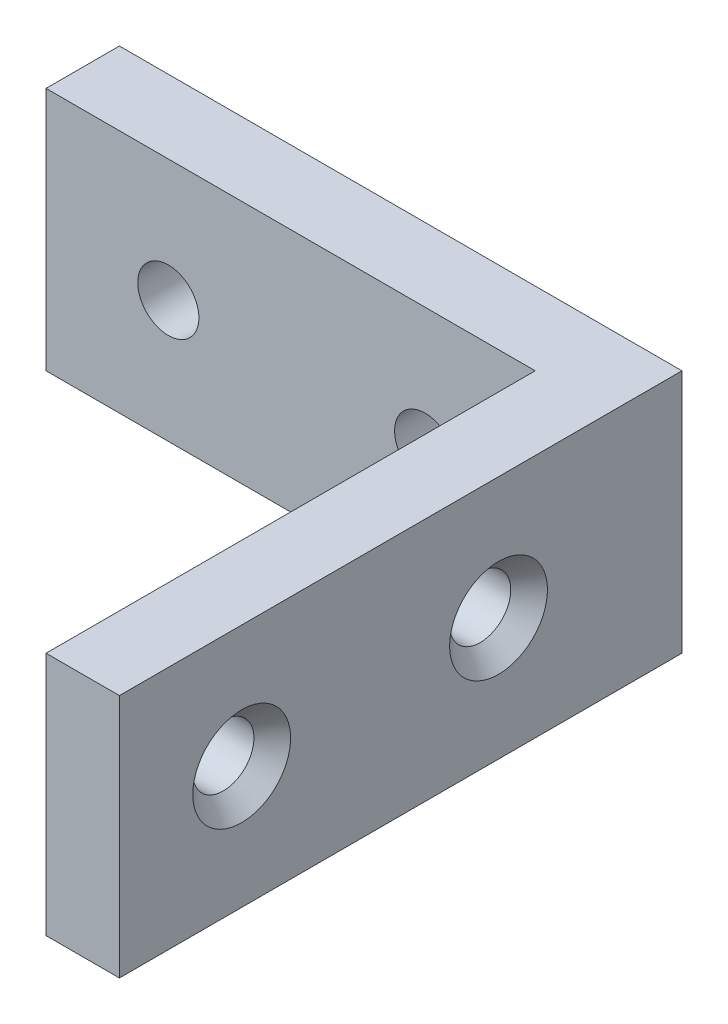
ISO-10303-21;
HEADER;
FILE_DESCRIPTION(('STEP AP214'),'2;1');
FILE_NAME('part.step','',(''),(''),'','','');
FILE_SCHEMA(('AUTOMOTIVE_DESIGN { 1 0 10303 214 1 1 1 1 }'));
ENDSEC;
DATA;
#1=APPLICATION_CONTEXT('core data for automotive mechanical design processes');
#2=APPLICATION_PROTOCOL_DEFINITION('international standard','automotive_design',2000,#1);
#3=PRODUCT_CONTEXT('',#1,'mechanical');
#4=PRODUCT('Part','Part','',(#3));
#5=PRODUCT_RELATED_PRODUCT_CATEGORY('part','',(#4));
#6=PRODUCT_DEFINITION_FORMATION('','',#4);
#7=PRODUCT_DEFINITION_CONTEXT('part definition',#1,'design');
#8=PRODUCT_DEFINITION('design','',#6,#7);
#9=PRODUCT_DEFINITION_SHAPE('','',#8);
#10=(LENGTH_UNIT() NAMED_UNIT(*) SI_UNIT(.MILLI.,.METRE.));
#11=(NAMED_UNIT(*) PLANE_ANGLE_UNIT() SI_UNIT($,.RADIAN.));
#12=(NAMED_UNIT(*) SI_UNIT($,.STERADIAN.) SOLID_ANGLE_UNIT());
#13=UNCERTAINTY_MEASURE_WITH_UNIT(LENGTH_MEASURE(1.E-05),#10,'distance_accuracy_value','');
#14=(GEOMETRIC_REPRESENTATION_CONTEXT(3) GLOBAL_UNCERTAINTY_ASSIGNED_CONTEXT((#13)) GLOBAL_UNIT_ASSIGNED_CONTEXT((#10,
#11,#12)) REPRESENTATION_CONTEXT('',''));
#15=CARTESIAN_POINT('',(0.,0.,0.));
#16=DIRECTION('',(0.,0.,1.));
#17=DIRECTION('',(1.,0.,0.));
#18=AXIS2_PLACEMENT_3D('',#15,#16,#17);
#19=CARTESIAN_POINT('',(0.,20.,-6.));
#20=DIRECTION('',(1.,0.,0.));
#21=DIRECTION('',(0.,0.,-1.));
#22=AXIS2_PLACEMENT_3D('',#19,#20,#21);
#23=PLANE('',#22);
#24=DIRECTION('',(0.,0.,1.));
#25=VECTOR('',#24,1.);
#26=CARTESIAN_POINT('',(0.,0.,-6.));
#27=LINE('',#26,#25);
#28=CARTESIAN_POINT('',(0.,0.,-6.));
#29=VERTEX_POINT('',#28);
#30=CARTESIAN_POINT('',(0.,0.,0.));
#31=VERTEX_POINT('',#30);
#32=EDGE_CURVE('E122',#29,#31,#27,.T.);
#33=ORIENTED_EDGE('',*,*,#32,.T.);
#34=DIRECTION('',(0.,-1.,0.));
#35=VECTOR('',#34,1.);
#36=CARTESIAN_POINT('',(0.,20.,0.));
#37=LINE('',#36,#35);
#38=CARTESIAN_POINT('',(0.,20.,0.));
#39=VERTEX_POINT('',#38);
#40=EDGE_CURVE('E140',#39,#31,#37,.T.);
#41=ORIENTED_EDGE('',*,*,#40,.F.);
#42=DIRECTION('',(0.,0.,1.));
#43=VECTOR('',#42,1.);
#44=CARTESIAN_POINT('',(0.,20.,-6.));
#45=LINE('',#44,#43);
#46=CARTESIAN_POINT('',(0.,20.,-6.));
#47=VERTEX_POINT('',#46);
#48=EDGE_CURVE('E133',#47,#39,#45,.T.);
#49=ORIENTED_EDGE('',*,*,#48,.F.);
#50=DIRECTION('',(0.,-1.,0.));
#51=VECTOR('',#50,1.);
#52=CARTESIAN_POINT('',(0.,20.,-6.));
#53=LINE('',#52,#51);
#54=EDGE_CURVE('E118',#47,#29,#53,.T.);
#55=ORIENTED_EDGE('',*,*,#54,.T.);
#56=EDGE_LOOP('',(#33,#41,#49,#55));
#57=FACE_BOUND('',#56,.T.);
#58=ADVANCED_FACE('F35',(#57),#23,.F.);
#59=CARTESIAN_POINT('',(0.,20.,0.));
#60=DIRECTION('',(0.,0.,-1.));
#61=DIRECTION('',(-1.,0.,0.));
#62=AXIS2_PLACEMENT_3D('',#59,#60,#61);
#63=PLANE('',#62);
#64=CARTESIAN_POINT('',(10.,10.,0.));
#65=DIRECTION('',(0.,0.,-1.));
#66=DIRECTION('',(-1.,0.,0.));
#67=AXIS2_PLACEMENT_3D('',#64,#65,#66);
#68=CIRCLE('',#67,2.5);
#69=CARTESIAN_POINT('',(7.5,10.,0.));
#70=VERTEX_POINT('',#69);
#71=EDGE_CURVE('E181',#70,#70,#68,.T.);
#72=ORIENTED_EDGE('',*,*,#71,.T.);
#73=EDGE_LOOP('',(#72));
#74=FACE_BOUND('',#73,.T.);
#75=CARTESIAN_POINT('',(31.,10.,0.));
#76=DIRECTION('',(0.,0.,-1.));
#77=DIRECTION('',(-1.,0.,0.));
#78=AXIS2_PLACEMENT_3D('',#75,#76,#77);
#79=CIRCLE('',#78,2.5);
#80=CARTESIAN_POINT('',(28.5,10.,0.));
#81=VERTEX_POINT('',#80);
#82=EDGE_CURVE('E179',#81,#81,#79,.T.);
#83=ORIENTED_EDGE('',*,*,#82,.T.);
#84=EDGE_LOOP('',(#83));
#85=FACE_BOUND('',#84,.T.);
#86=DIRECTION('',(1.,0.,0.));
#87=VECTOR('',#86,1.);
#88=CARTESIAN_POINT('',(0.,0.,0.));
#89=LINE('',#88,#87);
#90=CARTESIAN_POINT('',(40.,0.,0.));
#91=VERTEX_POINT('',#90);
#92=EDGE_CURVE('E125',#31,#91,#89,.T.);
#93=ORIENTED_EDGE('',*,*,#92,.T.);
#94=DIRECTION('',(0.,-1.,0.));
#95=VECTOR('',#94,1.);
#96=CARTESIAN_POINT('',(40.,20.,0.));
#97=LINE('',#96,#95);
#98=CARTESIAN_POINT('',(40.,20.,0.));
#99=VERTEX_POINT('',#98);
#100=EDGE_CURVE('E137',#99,#91,#97,.T.);
#101=ORIENTED_EDGE('',*,*,#100,.F.);
#102=DIRECTION('',(1.,0.,0.));
#103=VECTOR('',#102,1.);
#104=CARTESIAN_POINT('',(0.,20.,0.));
#105=LINE('',#104,#103);
#106=EDGE_CURVE('E91',#39,#99,#105,.T.);
#107=ORIENTED_EDGE('',*,*,#106,.F.);
#108=ORIENTED_EDGE('',*,*,#40,.T.);
#109=EDGE_LOOP('',(#93,#101,#107,#108));
#110=FACE_BOUND('',#109,.T.);
#111=ADVANCED_FACE('F194',(#74,#85,#110),#63,.F.);
#112=CARTESIAN_POINT('',(40.,20.,0.));
#113=DIRECTION('',(1.,0.,0.));
#114=DIRECTION('',(0.,0.,-1.));
#115=AXIS2_PLACEMENT_3D('',#112,#113,#114);
#116=PLANE('',#115);
#117=CARTESIAN_POINT('',(40.,10.,30.));
#118=DIRECTION('',(1.,0.,0.));
#119=DIRECTION('',(0.,0.,-1.));
#120=AXIS2_PLACEMENT_3D('',#117,#118,#119);
#121=CIRCLE('',#120,2.5);
#122=CARTESIAN_POINT('',(40.,10.,27.5));
#123=VERTEX_POINT('',#122);
#124=EDGE_CURVE('E126',#123,#123,#121,.F.);
#125=ORIENTED_EDGE('',*,*,#124,.F.);
#126=EDGE_LOOP('',(#125));
#127=FACE_BOUND('',#126,.T.);
#128=CARTESIAN_POINT('',(40.,10.,9.));
#129=DIRECTION('',(1.,0.,0.));
#130=DIRECTION('',(0.,0.,-1.));
#131=AXIS2_PLACEMENT_3D('',#128,#129,#130);
#132=CIRCLE('',#131,2.5);
#133=CARTESIAN_POINT('',(40.,10.,6.5));
#134=VERTEX_POINT('',#133);
#135=EDGE_CURVE('E184',#134,#134,#132,.F.);
#136=ORIENTED_EDGE('',*,*,#135,.F.);
#137=EDGE_LOOP('',(#136));
#138=FACE_BOUND('',#137,.T.);
#139=DIRECTION('',(0.,0.,1.));
#140=VECTOR('',#139,1.);
#141=CARTESIAN_POINT('',(40.,0.,0.));
#142=LINE('',#141,#140);
#143=CARTESIAN_POINT('',(40.,0.,40.));
#144=VERTEX_POINT('',#143);
#145=EDGE_CURVE('E128',#91,#144,#142,.T.);
#146=ORIENTED_EDGE('',*,*,#145,.T.);
#147=DIRECTION('',(0.,-1.,0.));
#148=VECTOR('',#147,1.);
#149=CARTESIAN_POINT('',(40.,20.,40.));
#150=LINE('',#149,#148);
#151=CARTESIAN_POINT('',(40.,20.,40.));
#152=VERTEX_POINT('',#151);
#153=EDGE_CURVE('E113',#152,#144,#150,.T.);
#154=ORIENTED_EDGE('',*,*,#153,.F.);
#155=DIRECTION('',(0.,0.,1.));
#156=VECTOR('',#155,1.);
#157=CARTESIAN_POINT('',(40.,20.,0.));
#158=LINE('',#157,#156);
#159=EDGE_CURVE('E104',#99,#152,#158,.T.);
#160=ORIENTED_EDGE('',*,*,#159,.F.);
#161=ORIENTED_EDGE('',*,*,#100,.T.);
#162=EDGE_LOOP('',(#146,#154,#160,#161));
#163=FACE_BOUND('',#162,.T.);
#164=ADVANCED_FACE('F197',(#127,#138,#163),#116,.F.);
#165=CARTESIAN_POINT('',(40.,20.,40.));
#166=DIRECTION('',(0.,0.,-1.));
#167=DIRECTION('',(-1.,0.,0.));
#168=AXIS2_PLACEMENT_3D('',#165,#166,#167);
#169=PLANE('',#168);
#170=DIRECTION('',(1.,0.,0.));
#171=VECTOR('',#170,1.);
#172=CARTESIAN_POINT('',(40.,0.,40.));
#173=LINE('',#172,#171);
#174=CARTESIAN_POINT('',(46.,0.,40.));
#175=VERTEX_POINT('',#174);
#176=EDGE_CURVE('E112',#144,#175,#173,.T.);
#177=ORIENTED_EDGE('',*,*,#176,.T.);
#178=DIRECTION('',(0.,-1.,0.));
#179=VECTOR('',#178,1.);
#180=CARTESIAN_POINT('',(46.,20.,40.));
#181=LINE('',#180,#179);
#182=CARTESIAN_POINT('',(46.,20.,40.));
#183=VERTEX_POINT('',#182);
#184=EDGE_CURVE('E109',#183,#175,#181,.T.);
#185=ORIENTED_EDGE('',*,*,#184,.F.);
#186=DIRECTION('',(1.,0.,0.));
#187=VECTOR('',#186,1.);
#188=CARTESIAN_POINT('',(40.,20.,40.));
#189=LINE('',#188,#187);
#190=EDGE_CURVE('E98',#152,#183,#189,.T.);
#191=ORIENTED_EDGE('',*,*,#190,.F.);
#192=ORIENTED_EDGE('',*,*,#153,.T.);
#193=EDGE_LOOP('',(#177,#185,#191,#192));
#194=FACE_BOUND('',#193,.T.);
#195=ADVANCED_FACE('F110',(#194),#169,.F.);
#196=CARTESIAN_POINT('',(46.,20.,-6.));
#197=DIRECTION('',(-1.,0.,0.));
#198=DIRECTION('',(0.,0.,1.));
#199=AXIS2_PLACEMENT_3D('',#196,#197,#198);
#200=PLANE('',#199);
#201=CARTESIAN_POINT('',(46.,10.,30.));
#202=DIRECTION('',(-1.,0.,0.));
#203=DIRECTION('',(0.,0.,1.));
#204=AXIS2_PLACEMENT_3D('',#201,#202,#203);
#205=CIRCLE('',#204,4.00000000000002);
#206=CARTESIAN_POINT('',(46.,10.,34.));
#207=VERTEX_POINT('',#206);
#208=EDGE_CURVE('E148',#207,#207,#205,.T.);
#209=ORIENTED_EDGE('',*,*,#208,.T.);
#210=EDGE_LOOP('',(#209));
#211=FACE_BOUND('',#210,.T.);
#212=CARTESIAN_POINT('',(46.,10.,9.));
#213=DIRECTION('',(-1.,0.,0.));
#214=DIRECTION('',(0.,0.,1.));
#215=AXIS2_PLACEMENT_3D('',#212,#213,#214);
#216=CIRCLE('',#215,4.);
#217=CARTESIAN_POINT('',(46.,10.,13.));
#218=VERTEX_POINT('',#217);
#219=EDGE_CURVE('E145',#218,#218,#216,.T.);
#220=ORIENTED_EDGE('',*,*,#219,.T.);
#221=EDGE_LOOP('',(#220));
#222=FACE_BOUND('',#221,.T.);
#223=DIRECTION('',(0.,0.,-1.));
#224=VECTOR('',#223,1.);
#225=CARTESIAN_POINT('',(46.,0.,-6.));
#226=LINE('',#225,#224);
#227=CARTESIAN_POINT('',(46.,0.,-6.));
#228=VERTEX_POINT('',#227);
#229=EDGE_CURVE('E76',#175,#228,#226,.T.);
#230=ORIENTED_EDGE('',*,*,#229,.T.);
#231=DIRECTION('',(0.,-1.,0.));
#232=VECTOR('',#231,1.);
#233=CARTESIAN_POINT('',(46.,20.,-6.));
#234=LINE('',#233,#232);
#235=CARTESIAN_POINT('',(46.,20.,-6.));
#236=VERTEX_POINT('',#235);
#237=EDGE_CURVE('E114',#236,#228,#234,.T.);
#238=ORIENTED_EDGE('',*,*,#237,.F.);
#239=DIRECTION('',(0.,0.,-1.));
#240=VECTOR('',#239,1.);
#241=CARTESIAN_POINT('',(46.,20.,-6.));
#242=LINE('',#241,#240);
#243=EDGE_CURVE('E102',#183,#236,#242,.T.);
#244=ORIENTED_EDGE('',*,*,#243,.F.);
#245=ORIENTED_EDGE('',*,*,#184,.T.);
#246=EDGE_LOOP('',(#230,#238,#244,#245));
#247=FACE_BOUND('',#246,.T.);
#248=ADVANCED_FACE('F116',(#211,#222,#247),#200,.F.);
#249=CARTESIAN_POINT('',(0.,20.,-6.));
#250=DIRECTION('',(0.,0.,1.));
#251=DIRECTION('',(1.,0.,0.));
#252=AXIS2_PLACEMENT_3D('',#249,#250,#251);
#253=PLANE('',#252);
#254=CARTESIAN_POINT('',(31.,10.,-6.));
#255=DIRECTION('',(0.,0.,1.));
#256=DIRECTION('',(1.,0.,0.));
#257=AXIS2_PLACEMENT_3D('',#254,#255,#256);
#258=CIRCLE('',#257,4.00000000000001);
#259=CARTESIAN_POINT('',(35.,10.,-6.));
#260=VERTEX_POINT('',#259);
#261=EDGE_CURVE('E45',#260,#260,#258,.T.);
#262=ORIENTED_EDGE('',*,*,#261,.T.);
#263=EDGE_LOOP('',(#262));
#264=FACE_BOUND('',#263,.T.);
#265=CARTESIAN_POINT('',(10.,10.,-6.));
#266=DIRECTION('',(0.,0.,1.));
#267=DIRECTION('',(1.,0.,0.));
#268=AXIS2_PLACEMENT_3D('',#265,#266,#267);
#269=CIRCLE('',#268,3.99999999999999);
#270=CARTESIAN_POINT('',(14.,10.,-6.));
#271=VERTEX_POINT('',#270);
#272=EDGE_CURVE('E157',#271,#271,#269,.T.);
#273=ORIENTED_EDGE('',*,*,#272,.T.);
#274=EDGE_LOOP('',(#273));
#275=FACE_BOUND('',#274,.T.);
#276=DIRECTION('',(-1.,0.,0.));
#277=VECTOR('',#276,1.);
#278=CARTESIAN_POINT('',(0.,0.,-6.));
#279=LINE('',#278,#277);
#280=EDGE_CURVE('E82',#228,#29,#279,.T.);
#281=ORIENTED_EDGE('',*,*,#280,.T.);
#282=ORIENTED_EDGE('',*,*,#54,.F.);
#283=DIRECTION('',(-1.,0.,0.));
#284=VECTOR('',#283,1.);
#285=CARTESIAN_POINT('',(0.,20.,-6.));
#286=LINE('',#285,#284);
#287=EDGE_CURVE('E53',#236,#47,#286,.T.);
#288=ORIENTED_EDGE('',*,*,#287,.F.);
#289=ORIENTED_EDGE('',*,*,#237,.T.);
#290=EDGE_LOOP('',(#281,#282,#288,#289));
#291=FACE_BOUND('',#290,.T.);
#292=ADVANCED_FACE('F162',(#264,#275,#291),#253,.F.);
#293=CARTESIAN_POINT('',(0.,20.,0.));
#294=DIRECTION('',(0.,1.,0.));
#295=DIRECTION('',(0.,0.,1.));
#296=AXIS2_PLACEMENT_3D('',#293,#294,#295);
#297=PLANE('',#296);
#298=ORIENTED_EDGE('',*,*,#48,.T.);
#299=ORIENTED_EDGE('',*,*,#106,.T.);
#300=ORIENTED_EDGE('',*,*,#159,.T.);
#301=ORIENTED_EDGE('',*,*,#190,.T.);
#302=ORIENTED_EDGE('',*,*,#243,.T.);
#303=ORIENTED_EDGE('',*,*,#287,.T.);
#304=EDGE_LOOP('',(#298,#299,#300,#301,#302,#303));
#305=FACE_BOUND('',#304,.T.);
#306=ADVANCED_FACE('F100',(#305),#297,.T.);
#307=CARTESIAN_POINT('',(0.,0.,0.));
#308=DIRECTION('',(0.,1.,0.));
#309=DIRECTION('',(0.,0.,1.));
#310=AXIS2_PLACEMENT_3D('',#307,#308,#309);
#311=PLANE('',#310);
#312=ORIENTED_EDGE('',*,*,#32,.F.);
#313=ORIENTED_EDGE('',*,*,#280,.F.);
#314=ORIENTED_EDGE('',*,*,#229,.F.);
#315=ORIENTED_EDGE('',*,*,#176,.F.);
#316=ORIENTED_EDGE('',*,*,#145,.F.);
#317=ORIENTED_EDGE('',*,*,#92,.F.);
#318=EDGE_LOOP('',(#312,#313,#314,#315,#316,#317));
#319=FACE_BOUND('',#318,.T.);
#320=ADVANCED_FACE('F200',(#319),#311,.F.);
#321=CARTESIAN_POINT('',(-0.001000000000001,10.,9.));
#322=DIRECTION('',(1.,0.,0.));
#323=DIRECTION('',(0.,0.,-1.));
#324=AXIS2_PLACEMENT_3D('',#321,#322,#323);
#325=CYLINDRICAL_SURFACE('',#324,2.5);
#326=CARTESIAN_POINT('',(44.5,10.,9.));
#327=DIRECTION('',(-1.,0.,0.));
#328=DIRECTION('',(0.,0.,1.));
#329=AXIS2_PLACEMENT_3D('',#326,#327,#328);
#330=CIRCLE('',#329,2.5);
#331=CARTESIAN_POINT('',(44.5,10.,11.5));
#332=VERTEX_POINT('',#331);
#333=EDGE_CURVE('E151',#332,#332,#330,.F.);
#334=ORIENTED_EDGE('',*,*,#333,.T.);
#335=EDGE_LOOP('',(#334));
#336=FACE_BOUND('',#335,.T.);
#337=ORIENTED_EDGE('',*,*,#135,.T.);
#338=EDGE_LOOP('',(#337));
#339=FACE_BOUND('',#338,.T.);
#340=ADVANCED_FACE('F244',(#336,#339),#325,.F.);
#341=CARTESIAN_POINT('',(-0.001000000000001,10.,30.));
#342=DIRECTION('',(1.,0.,0.));
#343=DIRECTION('',(0.,0.,-1.));
#344=AXIS2_PLACEMENT_3D('',#341,#342,#343);
#345=CYLINDRICAL_SURFACE('',#344,2.5);
#346=CARTESIAN_POINT('',(44.5,10.,30.));
#347=DIRECTION('',(-1.,0.,0.));
#348=DIRECTION('',(0.,0.,1.));
#349=AXIS2_PLACEMENT_3D('',#346,#347,#348);
#350=CIRCLE('',#349,2.5);
#351=CARTESIAN_POINT('',(44.5,10.,32.5));
#352=VERTEX_POINT('',#351);
#353=EDGE_CURVE('E142',#352,#352,#350,.F.);
#354=ORIENTED_EDGE('',*,*,#353,.T.);
#355=EDGE_LOOP('',(#354));
#356=FACE_BOUND('',#355,.T.);
#357=ORIENTED_EDGE('',*,*,#124,.T.);
#358=EDGE_LOOP('',(#357));
#359=FACE_BOUND('',#358,.T.);
#360=ADVANCED_FACE('F175',(#356,#359),#345,.F.);
#361=CARTESIAN_POINT('',(31.,10.,14.));
#362=DIRECTION('',(0.,0.,-1.));
#363=DIRECTION('',(-1.,0.,0.));
#364=AXIS2_PLACEMENT_3D('',#361,#362,#363);
#365=CYLINDRICAL_SURFACE('',#364,2.5);
#366=CARTESIAN_POINT('',(31.,10.,-4.5));
#367=DIRECTION('',(0.,0.,1.));
#368=DIRECTION('',(1.,0.,0.));
#369=AXIS2_PLACEMENT_3D('',#366,#367,#368);
#370=CIRCLE('',#369,2.5);
#371=CARTESIAN_POINT('',(33.5,10.,-4.5));
#372=VERTEX_POINT('',#371);
#373=EDGE_CURVE('E154',#372,#372,#370,.F.);
#374=ORIENTED_EDGE('',*,*,#373,.T.);
#375=EDGE_LOOP('',(#374));
#376=FACE_BOUND('',#375,.T.);
#377=ORIENTED_EDGE('',*,*,#82,.F.);
#378=EDGE_LOOP('',(#377));
#379=FACE_BOUND('',#378,.T.);
#380=ADVANCED_FACE('F171',(#376,#379),#365,.F.);
#381=CARTESIAN_POINT('',(10.,10.,14.));
#382=DIRECTION('',(0.,0.,-1.));
#383=DIRECTION('',(-1.,0.,0.));
#384=AXIS2_PLACEMENT_3D('',#381,#382,#383);
#385=CYLINDRICAL_SURFACE('',#384,2.5);
#386=CARTESIAN_POINT('',(10.,10.,-4.50000000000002));
#387=DIRECTION('',(0.,0.,1.));
#388=DIRECTION('',(1.,0.,0.));
#389=AXIS2_PLACEMENT_3D('',#386,#387,#388);
#390=CIRCLE('',#389,2.5);
#391=CARTESIAN_POINT('',(12.5,10.,-4.50000000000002));
#392=VERTEX_POINT('',#391);
#393=EDGE_CURVE('E11',#392,#392,#390,.F.);
#394=ORIENTED_EDGE('',*,*,#393,.T.);
#395=EDGE_LOOP('',(#394));
#396=FACE_BOUND('',#395,.T.);
#397=ORIENTED_EDGE('',*,*,#71,.F.);
#398=EDGE_LOOP('',(#397));
#399=FACE_BOUND('',#398,.T.);
#400=ADVANCED_FACE('F174',(#396,#399),#385,.F.);
#401=CARTESIAN_POINT('',(44.5,10.,30.));
#402=DIRECTION('',(1.,0.,0.));
#403=DIRECTION('',(0.,0.,-1.));
#404=AXIS2_PLACEMENT_3D('',#401,#402,#403);
#405=CONICAL_SURFACE('',#404,2.5,0.78539816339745);
#406=ORIENTED_EDGE('',*,*,#208,.F.);
#407=EDGE_LOOP('',(#406));
#408=FACE_BOUND('',#407,.T.);
#409=ORIENTED_EDGE('',*,*,#353,.F.);
#410=EDGE_LOOP('',(#409));
#411=FACE_BOUND('',#410,.T.);
#412=ADVANCED_FACE('F222',(#408,#411),#405,.F.);
#413=CARTESIAN_POINT('',(44.5,10.,9.));
#414=DIRECTION('',(1.,0.,0.));
#415=DIRECTION('',(0.,0.,-1.));
#416=AXIS2_PLACEMENT_3D('',#413,#414,#415);
#417=CONICAL_SURFACE('',#416,2.5,0.785398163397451);
#418=ORIENTED_EDGE('',*,*,#219,.F.);
#419=EDGE_LOOP('',(#418));
#420=FACE_BOUND('',#419,.T.);
#421=ORIENTED_EDGE('',*,*,#333,.F.);
#422=EDGE_LOOP('',(#421));
#423=FACE_BOUND('',#422,.T.);
#424=ADVANCED_FACE('F168',(#420,#423),#417,.F.);
#425=CARTESIAN_POINT('',(31.,10.,-4.5));
#426=DIRECTION('',(0.,0.,-1.));
#427=DIRECTION('',(-1.,0.,0.));
#428=AXIS2_PLACEMENT_3D('',#425,#426,#427);
#429=CONICAL_SURFACE('',#428,2.5,0.785398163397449);
#430=ORIENTED_EDGE('',*,*,#261,.F.);
#431=EDGE_LOOP('',(#430));
#432=FACE_BOUND('',#431,.T.);
#433=ORIENTED_EDGE('',*,*,#373,.F.);
#434=EDGE_LOOP('',(#433));
#435=FACE_BOUND('',#434,.T.);
#436=ADVANCED_FACE('F165',(#432,#435),#429,.F.);
#437=CARTESIAN_POINT('',(10.,10.,-4.50000000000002));
#438=DIRECTION('',(0.,0.,-1.));
#439=DIRECTION('',(-1.,0.,0.));
#440=AXIS2_PLACEMENT_3D('',#437,#438,#439);
#441=CONICAL_SURFACE('',#440,2.5,0.78539816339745);
#442=ORIENTED_EDGE('',*,*,#272,.F.);
#443=EDGE_LOOP('',(#442));
#444=FACE_BOUND('',#443,.T.);
#445=ORIENTED_EDGE('',*,*,#393,.F.);
#446=EDGE_LOOP('',(#445));
#447=FACE_BOUND('',#446,.T.);
#448=ADVANCED_FACE('F38',(#444,#447),#441,.F.);
#449=CLOSED_SHELL('',(#58,#111,#164,#195,#248,#292,#306,#320,#340,#360,#380,#400,#412,#424,#436,#448));
#450=MANIFOLD_SOLID_BREP('B2',#449);
#451=ADVANCED_BREP_SHAPE_REPRESENTATION('',(#18,#450),#14);
#452=SHAPE_DEFINITION_REPRESENTATION(#9,#451);
ENDSEC;
END-ISO-10303-21;
